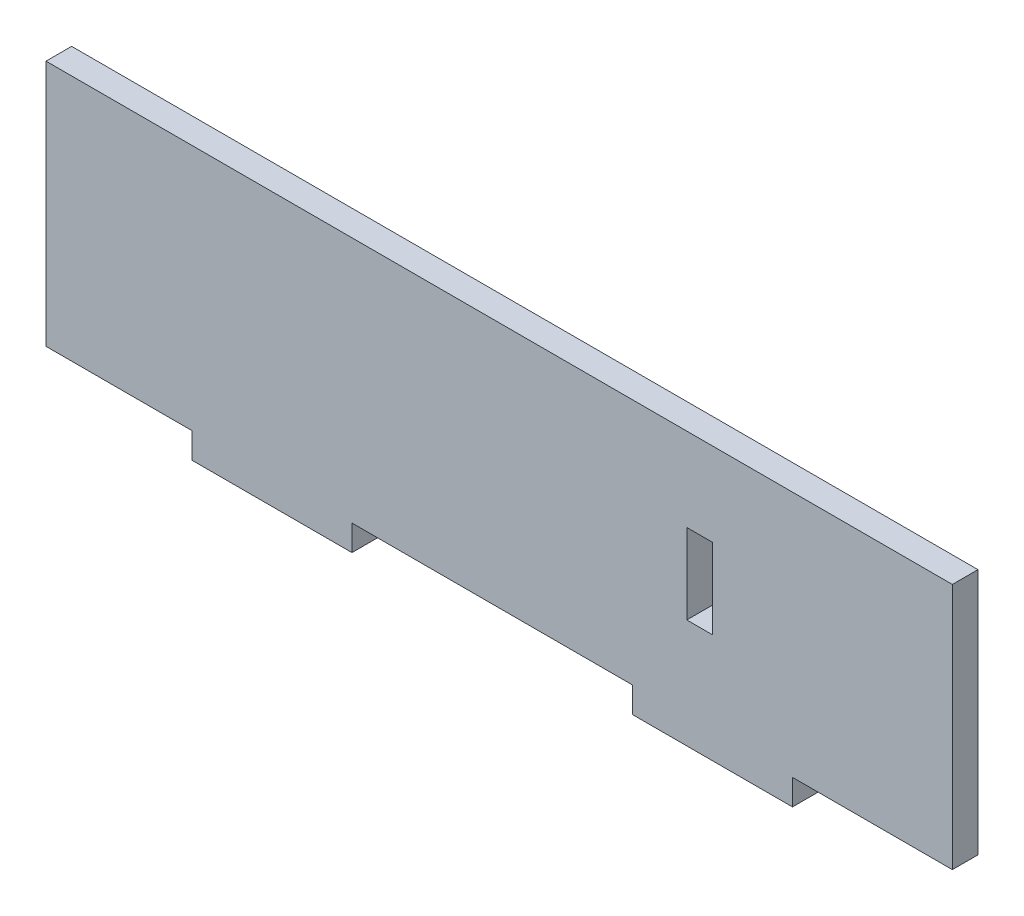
ISO-10303-21;
HEADER;
FILE_DESCRIPTION(('STEP AP214'),'2;1');
FILE_NAME('part.step','',(''),(''),'','','');
FILE_SCHEMA(('AUTOMOTIVE_DESIGN { 1 0 10303 214 1 1 1 1 }'));
ENDSEC;
DATA;
#1=APPLICATION_CONTEXT('core data for automotive mechanical design processes');
#2=APPLICATION_PROTOCOL_DEFINITION('international standard','automotive_design',2000,#1);
#3=PRODUCT_CONTEXT('',#1,'mechanical');
#4=PRODUCT('Part','Part','',(#3));
#5=PRODUCT_RELATED_PRODUCT_CATEGORY('part','',(#4));
#6=PRODUCT_DEFINITION_FORMATION('','',#4);
#7=PRODUCT_DEFINITION_CONTEXT('part definition',#1,'design');
#8=PRODUCT_DEFINITION('design','',#6,#7);
#9=PRODUCT_DEFINITION_SHAPE('','',#8);
#10=(LENGTH_UNIT() NAMED_UNIT(*) SI_UNIT(.MILLI.,.METRE.));
#11=(NAMED_UNIT(*) PLANE_ANGLE_UNIT() SI_UNIT($,.RADIAN.));
#12=(NAMED_UNIT(*) SI_UNIT($,.STERADIAN.) SOLID_ANGLE_UNIT());
#13=UNCERTAINTY_MEASURE_WITH_UNIT(LENGTH_MEASURE(1.E-05),#10,'distance_accuracy_value','');
#14=(GEOMETRIC_REPRESENTATION_CONTEXT(3) GLOBAL_UNCERTAINTY_ASSIGNED_CONTEXT((#13)) GLOBAL_UNIT_ASSIGNED_CONTEXT((#10,
#11,#12)) REPRESENTATION_CONTEXT('',''));
#15=CARTESIAN_POINT('',(0.,0.,0.));
#16=DIRECTION('',(0.,0.,1.));
#17=DIRECTION('',(1.,0.,0.));
#18=AXIS2_PLACEMENT_3D('',#15,#16,#17);
#19=CARTESIAN_POINT('',(200.,3.38569653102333,16.));
#20=DIRECTION('',(1.,0.,0.));
#21=DIRECTION('',(0.,0.,-1.));
#22=AXIS2_PLACEMENT_3D('',#19,#20,#21);
#23=PLANE('',#22);
#24=DIRECTION('',(0.,-1.,0.));
#25=VECTOR('',#24,1.);
#26=CARTESIAN_POINT('',(200.,3.38569653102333,0.));
#27=LINE('',#26,#25);
#28=CARTESIAN_POINT('',(200.,3.38569653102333,0.));
#29=VERTEX_POINT('',#28);
#30=CARTESIAN_POINT('',(200.,-12.6143034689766,0.));
#31=VERTEX_POINT('',#30);
#32=EDGE_CURVE('E225',#29,#31,#27,.T.);
#33=ORIENTED_EDGE('',*,*,#32,.F.);
#34=DIRECTION('',(0.,0.,-1.));
#35=VECTOR('',#34,1.);
#36=CARTESIAN_POINT('',(200.,3.38569653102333,16.));
#37=LINE('',#36,#35);
#38=CARTESIAN_POINT('',(200.,3.38569653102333,16.));
#39=VERTEX_POINT('',#38);
#40=EDGE_CURVE('E12',#39,#29,#37,.T.);
#41=ORIENTED_EDGE('',*,*,#40,.F.);
#42=DIRECTION('',(0.,-1.,0.));
#43=VECTOR('',#42,1.);
#44=CARTESIAN_POINT('',(200.,3.38569653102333,16.));
#45=LINE('',#44,#43);
#46=CARTESIAN_POINT('',(200.,-12.6143034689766,16.));
#47=VERTEX_POINT('',#46);
#48=EDGE_CURVE('E229',#39,#47,#45,.T.);
#49=ORIENTED_EDGE('',*,*,#48,.T.);
#50=DIRECTION('',(0.,0.,-1.));
#51=VECTOR('',#50,1.);
#52=CARTESIAN_POINT('',(200.,-12.6143034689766,16.));
#53=LINE('',#52,#51);
#54=EDGE_CURVE('E84',#47,#31,#53,.T.);
#55=ORIENTED_EDGE('',*,*,#54,.T.);
#56=EDGE_LOOP('',(#33,#41,#49,#55));
#57=FACE_BOUND('',#56,.T.);
#58=ADVANCED_FACE('F81',(#57),#23,.T.);
#59=CARTESIAN_POINT('',(200.,3.38569653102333,16.));
#60=DIRECTION('',(0.,1.,0.));
#61=DIRECTION('',(0.,0.,1.));
#62=AXIS2_PLACEMENT_3D('',#59,#60,#61);
#63=PLANE('',#62);
#64=DIRECTION('',(1.,0.,0.));
#65=VECTOR('',#64,1.);
#66=CARTESIAN_POINT('',(200.,3.38569653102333,0.));
#67=LINE('',#66,#65);
#68=CARTESIAN_POINT('',(375.,3.38569653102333,0.));
#69=VERTEX_POINT('',#68);
#70=EDGE_CURVE('E233',#29,#69,#67,.T.);
#71=ORIENTED_EDGE('',*,*,#70,.T.);
#72=DIRECTION('',(0.,0.,-1.));
#73=VECTOR('',#72,1.);
#74=CARTESIAN_POINT('',(375.,3.38569653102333,16.));
#75=LINE('',#74,#73);
#76=CARTESIAN_POINT('',(375.,3.38569653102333,16.));
#77=VERTEX_POINT('',#76);
#78=EDGE_CURVE('E89',#77,#69,#75,.T.);
#79=ORIENTED_EDGE('',*,*,#78,.F.);
#80=DIRECTION('',(1.,0.,0.));
#81=VECTOR('',#80,1.);
#82=CARTESIAN_POINT('',(200.,3.38569653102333,16.));
#83=LINE('',#82,#81);
#84=EDGE_CURVE('E256',#39,#77,#83,.T.);
#85=ORIENTED_EDGE('',*,*,#84,.F.);
#86=ORIENTED_EDGE('',*,*,#40,.T.);
#87=EDGE_LOOP('',(#71,#79,#85,#86));
#88=FACE_BOUND('',#87,.T.);
#89=ADVANCED_FACE('F326',(#88),#63,.F.);
#90=CARTESIAN_POINT('',(375.,3.38569653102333,16.));
#91=DIRECTION('',(1.,0.,0.));
#92=DIRECTION('',(0.,0.,-1.));
#93=AXIS2_PLACEMENT_3D('',#90,#91,#92);
#94=PLANE('',#93);
#95=DIRECTION('',(0.,-1.,0.));
#96=VECTOR('',#95,1.);
#97=CARTESIAN_POINT('',(375.,3.38569653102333,0.));
#98=LINE('',#97,#96);
#99=CARTESIAN_POINT('',(375.,-12.6143034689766,0.));
#100=VERTEX_POINT('',#99);
#101=EDGE_CURVE('E284',#69,#100,#98,.T.);
#102=ORIENTED_EDGE('',*,*,#101,.T.);
#103=DIRECTION('',(0.,0.,-1.));
#104=VECTOR('',#103,1.);
#105=CARTESIAN_POINT('',(375.,-12.6143034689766,16.));
#106=LINE('',#105,#104);
#107=CARTESIAN_POINT('',(375.,-12.6143034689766,16.));
#108=VERTEX_POINT('',#107);
#109=EDGE_CURVE('E289',#108,#100,#106,.T.);
#110=ORIENTED_EDGE('',*,*,#109,.F.);
#111=DIRECTION('',(0.,-1.,0.));
#112=VECTOR('',#111,1.);
#113=CARTESIAN_POINT('',(375.,3.38569653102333,16.));
#114=LINE('',#113,#112);
#115=EDGE_CURVE('E254',#77,#108,#114,.T.);
#116=ORIENTED_EDGE('',*,*,#115,.F.);
#117=ORIENTED_EDGE('',*,*,#78,.T.);
#118=EDGE_LOOP('',(#102,#110,#116,#117));
#119=FACE_BOUND('',#118,.T.);
#120=ADVANCED_FACE('F330',(#119),#94,.F.);
#121=CARTESIAN_POINT('',(375.,-12.6143034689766,16.));
#122=DIRECTION('',(0.,1.,0.));
#123=DIRECTION('',(0.,0.,1.));
#124=AXIS2_PLACEMENT_3D('',#121,#122,#123);
#125=PLANE('',#124);
#126=DIRECTION('',(1.,0.,0.));
#127=VECTOR('',#126,1.);
#128=CARTESIAN_POINT('',(375.,-12.6143034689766,0.));
#129=LINE('',#128,#127);
#130=CARTESIAN_POINT('',(475.,-12.6143034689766,0.));
#131=VERTEX_POINT('',#130);
#132=EDGE_CURVE('E281',#100,#131,#129,.T.);
#133=ORIENTED_EDGE('',*,*,#132,.T.);
#134=DIRECTION('',(0.,0.,-1.));
#135=VECTOR('',#134,1.);
#136=CARTESIAN_POINT('',(475.,-12.6143034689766,16.));
#137=LINE('',#136,#135);
#138=CARTESIAN_POINT('',(475.,-12.6143034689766,16.));
#139=VERTEX_POINT('',#138);
#140=EDGE_CURVE('E292',#139,#131,#137,.T.);
#141=ORIENTED_EDGE('',*,*,#140,.F.);
#142=DIRECTION('',(1.,0.,0.));
#143=VECTOR('',#142,1.);
#144=CARTESIAN_POINT('',(375.,-12.6143034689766,16.));
#145=LINE('',#144,#143);
#146=EDGE_CURVE('E252',#108,#139,#145,.T.);
#147=ORIENTED_EDGE('',*,*,#146,.F.);
#148=ORIENTED_EDGE('',*,*,#109,.T.);
#149=EDGE_LOOP('',(#133,#141,#147,#148));
#150=FACE_BOUND('',#149,.T.);
#151=ADVANCED_FACE('F365',(#150),#125,.F.);
#152=CARTESIAN_POINT('',(475.,3.38569653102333,16.));
#153=DIRECTION('',(1.,0.,0.));
#154=DIRECTION('',(0.,0.,-1.));
#155=AXIS2_PLACEMENT_3D('',#152,#153,#154);
#156=PLANE('',#155);
#157=DIRECTION('',(0.,-1.,0.));
#158=VECTOR('',#157,1.);
#159=CARTESIAN_POINT('',(475.,3.38569653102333,0.));
#160=LINE('',#159,#158);
#161=CARTESIAN_POINT('',(475.,3.38569653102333,0.));
#162=VERTEX_POINT('',#161);
#163=EDGE_CURVE('E278',#162,#131,#160,.T.);
#164=ORIENTED_EDGE('',*,*,#163,.F.);
#165=DIRECTION('',(0.,0.,-1.));
#166=VECTOR('',#165,1.);
#167=CARTESIAN_POINT('',(475.,3.38569653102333,16.));
#168=LINE('',#167,#166);
#169=CARTESIAN_POINT('',(475.,3.38569653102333,16.));
#170=VERTEX_POINT('',#169);
#171=EDGE_CURVE('E294',#170,#162,#168,.T.);
#172=ORIENTED_EDGE('',*,*,#171,.F.);
#173=DIRECTION('',(0.,-1.,0.));
#174=VECTOR('',#173,1.);
#175=CARTESIAN_POINT('',(475.,3.38569653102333,16.));
#176=LINE('',#175,#174);
#177=EDGE_CURVE('E249',#170,#139,#176,.T.);
#178=ORIENTED_EDGE('',*,*,#177,.T.);
#179=ORIENTED_EDGE('',*,*,#140,.T.);
#180=EDGE_LOOP('',(#164,#172,#178,#179));
#181=FACE_BOUND('',#180,.T.);
#182=ADVANCED_FACE('F363',(#181),#156,.T.);
#183=CARTESIAN_POINT('',(475.,3.38569653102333,16.));
#184=DIRECTION('',(0.,1.,0.));
#185=DIRECTION('',(0.,0.,1.));
#186=AXIS2_PLACEMENT_3D('',#183,#184,#185);
#187=PLANE('',#186);
#188=DIRECTION('',(1.,0.,0.));
#189=VECTOR('',#188,1.);
#190=CARTESIAN_POINT('',(475.,3.38569653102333,0.));
#191=LINE('',#190,#189);
#192=CARTESIAN_POINT('',(574.8,3.38569653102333,0.));
#193=VERTEX_POINT('',#192);
#194=EDGE_CURVE('E275',#162,#193,#191,.T.);
#195=ORIENTED_EDGE('',*,*,#194,.T.);
#196=DIRECTION('',(0.,0.,-1.));
#197=VECTOR('',#196,1.);
#198=CARTESIAN_POINT('',(574.8,3.38569653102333,16.));
#199=LINE('',#198,#197);
#200=CARTESIAN_POINT('',(574.8,3.38569653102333,16.));
#201=VERTEX_POINT('',#200);
#202=EDGE_CURVE('E296',#201,#193,#199,.T.);
#203=ORIENTED_EDGE('',*,*,#202,.F.);
#204=DIRECTION('',(1.,0.,0.));
#205=VECTOR('',#204,1.);
#206=CARTESIAN_POINT('',(475.,3.38569653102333,16.));
#207=LINE('',#206,#205);
#208=EDGE_CURVE('E247',#170,#201,#207,.T.);
#209=ORIENTED_EDGE('',*,*,#208,.F.);
#210=ORIENTED_EDGE('',*,*,#171,.T.);
#211=EDGE_LOOP('',(#195,#203,#209,#210));
#212=FACE_BOUND('',#211,.T.);
#213=ADVANCED_FACE('F361',(#212),#187,.F.);
#214=CARTESIAN_POINT('',(574.8,157.585696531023,16.));
#215=DIRECTION('',(1.,0.,0.));
#216=DIRECTION('',(0.,0.,-1.));
#217=AXIS2_PLACEMENT_3D('',#214,#215,#216);
#218=PLANE('',#217);
#219=DIRECTION('',(0.,-1.,0.));
#220=VECTOR('',#219,1.);
#221=CARTESIAN_POINT('',(574.8,157.585696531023,0.));
#222=LINE('',#221,#220);
#223=CARTESIAN_POINT('',(574.8,157.585696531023,0.));
#224=VERTEX_POINT('',#223);
#225=EDGE_CURVE('E272',#224,#193,#222,.T.);
#226=ORIENTED_EDGE('',*,*,#225,.F.);
#227=DIRECTION('',(0.,0.,-1.));
#228=VECTOR('',#227,1.);
#229=CARTESIAN_POINT('',(574.8,157.585696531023,16.));
#230=LINE('',#229,#228);
#231=CARTESIAN_POINT('',(574.8,157.585696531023,16.));
#232=VERTEX_POINT('',#231);
#233=EDGE_CURVE('E298',#232,#224,#230,.T.);
#234=ORIENTED_EDGE('',*,*,#233,.F.);
#235=DIRECTION('',(0.,-1.,0.));
#236=VECTOR('',#235,1.);
#237=CARTESIAN_POINT('',(574.8,157.585696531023,16.));
#238=LINE('',#237,#236);
#239=EDGE_CURVE('E244',#232,#201,#238,.T.);
#240=ORIENTED_EDGE('',*,*,#239,.T.);
#241=ORIENTED_EDGE('',*,*,#202,.T.);
#242=EDGE_LOOP('',(#226,#234,#240,#241));
#243=FACE_BOUND('',#242,.T.);
#244=ADVANCED_FACE('F356',(#243),#218,.T.);
#245=CARTESIAN_POINT('',(9.00000000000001,157.585696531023,16.));
#246=DIRECTION('',(0.,1.,0.));
#247=DIRECTION('',(0.,0.,1.));
#248=AXIS2_PLACEMENT_3D('',#245,#246,#247);
#249=PLANE('',#248);
#250=DIRECTION('',(1.,0.,0.));
#251=VECTOR('',#250,1.);
#252=CARTESIAN_POINT('',(9.00000000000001,157.585696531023,0.));
#253=LINE('',#252,#251);
#254=CARTESIAN_POINT('',(9.00000000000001,157.585696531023,0.));
#255=VERTEX_POINT('',#254);
#256=EDGE_CURVE('E269',#255,#224,#253,.T.);
#257=ORIENTED_EDGE('',*,*,#256,.F.);
#258=DIRECTION('',(0.,0.,-1.));
#259=VECTOR('',#258,1.);
#260=CARTESIAN_POINT('',(9.00000000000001,157.585696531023,16.));
#261=LINE('',#260,#259);
#262=CARTESIAN_POINT('',(9.00000000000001,157.585696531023,16.));
#263=VERTEX_POINT('',#262);
#264=EDGE_CURVE('E300',#263,#255,#261,.T.);
#265=ORIENTED_EDGE('',*,*,#264,.F.);
#266=DIRECTION('',(1.,0.,0.));
#267=VECTOR('',#266,1.);
#268=CARTESIAN_POINT('',(9.00000000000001,157.585696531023,16.));
#269=LINE('',#268,#267);
#270=EDGE_CURVE('E241',#263,#232,#269,.T.);
#271=ORIENTED_EDGE('',*,*,#270,.T.);
#272=ORIENTED_EDGE('',*,*,#233,.T.);
#273=EDGE_LOOP('',(#257,#265,#271,#272));
#274=FACE_BOUND('',#273,.T.);
#275=ADVANCED_FACE('F351',(#274),#249,.T.);
#276=CARTESIAN_POINT('',(9.00000000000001,157.585696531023,16.));
#277=DIRECTION('',(1.,0.,0.));
#278=DIRECTION('',(0.,0.,-1.));
#279=AXIS2_PLACEMENT_3D('',#276,#277,#278);
#280=PLANE('',#279);
#281=DIRECTION('',(0.,-1.,0.));
#282=VECTOR('',#281,1.);
#283=CARTESIAN_POINT('',(9.00000000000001,157.585696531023,0.));
#284=LINE('',#283,#282);
#285=CARTESIAN_POINT('',(9.00000000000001,3.38569653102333,0.));
#286=VERTEX_POINT('',#285);
#287=EDGE_CURVE('E267',#255,#286,#284,.T.);
#288=ORIENTED_EDGE('',*,*,#287,.T.);
#289=DIRECTION('',(0.,0.,-1.));
#290=VECTOR('',#289,1.);
#291=CARTESIAN_POINT('',(9.00000000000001,3.38569653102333,16.));
#292=LINE('',#291,#290);
#293=CARTESIAN_POINT('',(9.00000000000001,3.38569653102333,16.));
#294=VERTEX_POINT('',#293);
#295=EDGE_CURVE('E302',#294,#286,#292,.T.);
#296=ORIENTED_EDGE('',*,*,#295,.F.);
#297=DIRECTION('',(0.,-1.,0.));
#298=VECTOR('',#297,1.);
#299=CARTESIAN_POINT('',(9.00000000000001,157.585696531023,16.));
#300=LINE('',#299,#298);
#301=EDGE_CURVE('E239',#263,#294,#300,.T.);
#302=ORIENTED_EDGE('',*,*,#301,.F.);
#303=ORIENTED_EDGE('',*,*,#264,.T.);
#304=EDGE_LOOP('',(#288,#296,#302,#303));
#305=FACE_BOUND('',#304,.T.);
#306=ADVANCED_FACE('F348',(#305),#280,.F.);
#307=CARTESIAN_POINT('',(9.00000000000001,3.38569653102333,16.));
#308=DIRECTION('',(0.,1.,0.));
#309=DIRECTION('',(0.,0.,1.));
#310=AXIS2_PLACEMENT_3D('',#307,#308,#309);
#311=PLANE('',#310);
#312=DIRECTION('',(1.,0.,0.));
#313=VECTOR('',#312,1.);
#314=CARTESIAN_POINT('',(9.00000000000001,3.38569653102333,0.));
#315=LINE('',#314,#313);
#316=CARTESIAN_POINT('',(100.,3.38569653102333,0.));
#317=VERTEX_POINT('',#316);
#318=EDGE_CURVE('E265',#286,#317,#315,.T.);
#319=ORIENTED_EDGE('',*,*,#318,.T.);
#320=DIRECTION('',(0.,0.,-1.));
#321=VECTOR('',#320,1.);
#322=CARTESIAN_POINT('',(100.,3.38569653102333,16.));
#323=LINE('',#322,#321);
#324=CARTESIAN_POINT('',(100.,3.38569653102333,16.));
#325=VERTEX_POINT('',#324);
#326=EDGE_CURVE('E305',#325,#317,#323,.T.);
#327=ORIENTED_EDGE('',*,*,#326,.F.);
#328=DIRECTION('',(1.,0.,0.));
#329=VECTOR('',#328,1.);
#330=CARTESIAN_POINT('',(9.00000000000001,3.38569653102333,16.));
#331=LINE('',#330,#329);
#332=EDGE_CURVE('E237',#294,#325,#331,.T.);
#333=ORIENTED_EDGE('',*,*,#332,.F.);
#334=ORIENTED_EDGE('',*,*,#295,.T.);
#335=EDGE_LOOP('',(#319,#327,#333,#334));
#336=FACE_BOUND('',#335,.T.);
#337=ADVANCED_FACE('F344',(#336),#311,.F.);
#338=CARTESIAN_POINT('',(100.,3.38569653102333,16.));
#339=DIRECTION('',(1.,0.,0.));
#340=DIRECTION('',(0.,0.,-1.));
#341=AXIS2_PLACEMENT_3D('',#338,#339,#340);
#342=PLANE('',#341);
#343=DIRECTION('',(0.,-1.,0.));
#344=VECTOR('',#343,1.);
#345=CARTESIAN_POINT('',(100.,3.38569653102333,0.));
#346=LINE('',#345,#344);
#347=CARTESIAN_POINT('',(100.,-12.6143034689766,0.));
#348=VERTEX_POINT('',#347);
#349=EDGE_CURVE('E263',#317,#348,#346,.T.);
#350=ORIENTED_EDGE('',*,*,#349,.T.);
#351=DIRECTION('',(0.,0.,-1.));
#352=VECTOR('',#351,1.);
#353=CARTESIAN_POINT('',(100.,-12.6143034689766,16.));
#354=LINE('',#353,#352);
#355=CARTESIAN_POINT('',(100.,-12.6143034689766,16.));
#356=VERTEX_POINT('',#355);
#357=EDGE_CURVE('E307',#356,#348,#354,.T.);
#358=ORIENTED_EDGE('',*,*,#357,.F.);
#359=DIRECTION('',(0.,-1.,0.));
#360=VECTOR('',#359,1.);
#361=CARTESIAN_POINT('',(100.,3.38569653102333,16.));
#362=LINE('',#361,#360);
#363=EDGE_CURVE('E235',#325,#356,#362,.T.);
#364=ORIENTED_EDGE('',*,*,#363,.F.);
#365=ORIENTED_EDGE('',*,*,#326,.T.);
#366=EDGE_LOOP('',(#350,#358,#364,#365));
#367=FACE_BOUND('',#366,.T.);
#368=ADVANCED_FACE('F339',(#367),#342,.F.);
#369=CARTESIAN_POINT('',(100.,-12.6143034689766,16.));
#370=DIRECTION('',(0.,1.,0.));
#371=DIRECTION('',(-1.,0.,0.));
#372=AXIS2_PLACEMENT_3D('',#369,#370,#371);
#373=PLANE('',#372);
#374=DIRECTION('',(1.,0.,0.));
#375=VECTOR('',#374,1.);
#376=CARTESIAN_POINT('',(100.,-12.6143034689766,0.));
#377=LINE('',#376,#375);
#378=EDGE_CURVE('E260',#348,#31,#377,.T.);
#379=ORIENTED_EDGE('',*,*,#378,.T.);
#380=ORIENTED_EDGE('',*,*,#54,.F.);
#381=DIRECTION('',(1.,0.,0.));
#382=VECTOR('',#381,1.);
#383=CARTESIAN_POINT('',(100.,-12.6143034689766,16.));
#384=LINE('',#383,#382);
#385=EDGE_CURVE('E232',#356,#47,#384,.T.);
#386=ORIENTED_EDGE('',*,*,#385,.F.);
#387=ORIENTED_EDGE('',*,*,#357,.T.);
#388=EDGE_LOOP('',(#379,#380,#386,#387));
#389=FACE_BOUND('',#388,.T.);
#390=ADVANCED_FACE('F317',(#389),#373,.F.);
#391=CARTESIAN_POINT('',(0.,0.,16.));
#392=DIRECTION('',(0.,0.,1.));
#393=DIRECTION('',(1.,0.,0.));
#394=AXIS2_PLACEMENT_3D('',#391,#392,#393);
#395=PLANE('',#394);
#396=DIRECTION('',(1.,0.,0.));
#397=VECTOR('',#396,1.);
#398=CARTESIAN_POINT('',(409.,105.485696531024,16.));
#399=LINE('',#398,#397);
#400=CARTESIAN_POINT('',(409.,105.485696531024,16.));
#401=VERTEX_POINT('',#400);
#402=CARTESIAN_POINT('',(425.,105.485696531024,16.));
#403=VERTEX_POINT('',#402);
#404=EDGE_CURVE('E196',#401,#403,#399,.T.);
#405=ORIENTED_EDGE('',*,*,#404,.T.);
#406=DIRECTION('',(0.,-1.,0.));
#407=VECTOR('',#406,1.);
#408=CARTESIAN_POINT('',(425.,105.485696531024,16.));
#409=LINE('',#408,#407);
#410=CARTESIAN_POINT('',(425.,55.4856965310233,16.));
#411=VERTEX_POINT('',#410);
#412=EDGE_CURVE('E202',#403,#411,#409,.T.);
#413=ORIENTED_EDGE('',*,*,#412,.T.);
#414=DIRECTION('',(1.,0.,0.));
#415=VECTOR('',#414,1.);
#416=CARTESIAN_POINT('',(409.,55.4856965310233,16.));
#417=LINE('',#416,#415);
#418=CARTESIAN_POINT('',(409.,55.4856965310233,16.));
#419=VERTEX_POINT('',#418);
#420=EDGE_CURVE('E206',#419,#411,#417,.T.);
#421=ORIENTED_EDGE('',*,*,#420,.F.);
#422=DIRECTION('',(0.,-1.,0.));
#423=VECTOR('',#422,1.);
#424=CARTESIAN_POINT('',(409.,105.485696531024,16.));
#425=LINE('',#424,#423);
#426=EDGE_CURVE('E199',#401,#419,#425,.T.);
#427=ORIENTED_EDGE('',*,*,#426,.F.);
#428=EDGE_LOOP('',(#405,#413,#421,#427));
#429=FACE_BOUND('',#428,.T.);
#430=ORIENTED_EDGE('',*,*,#48,.F.);
#431=ORIENTED_EDGE('',*,*,#84,.T.);
#432=ORIENTED_EDGE('',*,*,#115,.T.);
#433=ORIENTED_EDGE('',*,*,#146,.T.);
#434=ORIENTED_EDGE('',*,*,#177,.F.);
#435=ORIENTED_EDGE('',*,*,#208,.T.);
#436=ORIENTED_EDGE('',*,*,#239,.F.);
#437=ORIENTED_EDGE('',*,*,#270,.F.);
#438=ORIENTED_EDGE('',*,*,#301,.T.);
#439=ORIENTED_EDGE('',*,*,#332,.T.);
#440=ORIENTED_EDGE('',*,*,#363,.T.);
#441=ORIENTED_EDGE('',*,*,#385,.T.);
#442=EDGE_LOOP('',(#430,#431,#432,#433,#434,#435,#436,#437,#438,#439,#440,#441));
#443=FACE_BOUND('',#442,.T.);
#444=ADVANCED_FACE('F208',(#429,#443),#395,.T.);
#445=CARTESIAN_POINT('',(0.,0.,0.));
#446=DIRECTION('',(0.,0.,1.));
#447=DIRECTION('',(1.,0.,0.));
#448=AXIS2_PLACEMENT_3D('',#445,#446,#447);
#449=PLANE('',#448);
#450=DIRECTION('',(0.,-1.,0.));
#451=VECTOR('',#450,1.);
#452=CARTESIAN_POINT('',(425.,105.485696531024,0.));
#453=LINE('',#452,#451);
#454=CARTESIAN_POINT('',(425.,105.485696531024,0.));
#455=VERTEX_POINT('',#454);
#456=CARTESIAN_POINT('',(425.,55.4856965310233,0.));
#457=VERTEX_POINT('',#456);
#458=EDGE_CURVE('E219',#455,#457,#453,.T.);
#459=ORIENTED_EDGE('',*,*,#458,.F.);
#460=DIRECTION('',(1.,0.,0.));
#461=VECTOR('',#460,1.);
#462=CARTESIAN_POINT('',(409.,105.485696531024,0.));
#463=LINE('',#462,#461);
#464=CARTESIAN_POINT('',(409.,105.485696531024,0.));
#465=VERTEX_POINT('',#464);
#466=EDGE_CURVE('E105',#465,#455,#463,.T.);
#467=ORIENTED_EDGE('',*,*,#466,.F.);
#468=DIRECTION('',(0.,-1.,0.));
#469=VECTOR('',#468,1.);
#470=CARTESIAN_POINT('',(409.,105.485696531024,0.));
#471=LINE('',#470,#469);
#472=CARTESIAN_POINT('',(409.,55.4856965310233,0.));
#473=VERTEX_POINT('',#472);
#474=EDGE_CURVE('E210',#465,#473,#471,.T.);
#475=ORIENTED_EDGE('',*,*,#474,.T.);
#476=DIRECTION('',(1.,0.,0.));
#477=VECTOR('',#476,1.);
#478=CARTESIAN_POINT('',(409.,55.4856965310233,0.));
#479=LINE('',#478,#477);
#480=EDGE_CURVE('E213',#473,#457,#479,.T.);
#481=ORIENTED_EDGE('',*,*,#480,.T.);
#482=EDGE_LOOP('',(#459,#467,#475,#481));
#483=FACE_BOUND('',#482,.T.);
#484=ORIENTED_EDGE('',*,*,#32,.T.);
#485=ORIENTED_EDGE('',*,*,#378,.F.);
#486=ORIENTED_EDGE('',*,*,#349,.F.);
#487=ORIENTED_EDGE('',*,*,#318,.F.);
#488=ORIENTED_EDGE('',*,*,#287,.F.);
#489=ORIENTED_EDGE('',*,*,#256,.T.);
#490=ORIENTED_EDGE('',*,*,#225,.T.);
#491=ORIENTED_EDGE('',*,*,#194,.F.);
#492=ORIENTED_EDGE('',*,*,#163,.T.);
#493=ORIENTED_EDGE('',*,*,#132,.F.);
#494=ORIENTED_EDGE('',*,*,#101,.F.);
#495=ORIENTED_EDGE('',*,*,#70,.F.);
#496=EDGE_LOOP('',(#484,#485,#486,#487,#488,#489,#490,#491,#492,#493,#494,#495));
#497=FACE_BOUND('',#496,.T.);
#498=ADVANCED_FACE('F321',(#483,#497),#449,.F.);
#499=CARTESIAN_POINT('',(409.,105.485696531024,16.));
#500=DIRECTION('',(0.,1.,0.));
#501=DIRECTION('',(-1.,0.,0.));
#502=AXIS2_PLACEMENT_3D('',#499,#500,#501);
#503=PLANE('',#502);
#504=ORIENTED_EDGE('',*,*,#466,.T.);
#505=DIRECTION('',(0.,0.,-1.));
#506=VECTOR('',#505,1.);
#507=CARTESIAN_POINT('',(425.,105.485696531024,16.));
#508=LINE('',#507,#506);
#509=EDGE_CURVE('E193',#403,#455,#508,.T.);
#510=ORIENTED_EDGE('',*,*,#509,.F.);
#511=ORIENTED_EDGE('',*,*,#404,.F.);
#512=DIRECTION('',(0.,0.,-1.));
#513=VECTOR('',#512,1.);
#514=CARTESIAN_POINT('',(409.,105.485696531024,16.));
#515=LINE('',#514,#513);
#516=EDGE_CURVE('E223',#401,#465,#515,.T.);
#517=ORIENTED_EDGE('',*,*,#516,.T.);
#518=EDGE_LOOP('',(#504,#510,#511,#517));
#519=FACE_BOUND('',#518,.T.);
#520=ADVANCED_FACE('F194',(#519),#503,.F.);
#521=CARTESIAN_POINT('',(409.,105.485696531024,16.));
#522=DIRECTION('',(1.,0.,0.));
#523=DIRECTION('',(0.,0.,-1.));
#524=AXIS2_PLACEMENT_3D('',#521,#522,#523);
#525=PLANE('',#524);
#526=ORIENTED_EDGE('',*,*,#474,.F.);
#527=ORIENTED_EDGE('',*,*,#516,.F.);
#528=ORIENTED_EDGE('',*,*,#426,.T.);
#529=DIRECTION('',(0.,0.,-1.));
#530=VECTOR('',#529,1.);
#531=CARTESIAN_POINT('',(409.,55.4856965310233,16.));
#532=LINE('',#531,#530);
#533=EDGE_CURVE('E226',#419,#473,#532,.T.);
#534=ORIENTED_EDGE('',*,*,#533,.T.);
#535=EDGE_LOOP('',(#526,#527,#528,#534));
#536=FACE_BOUND('',#535,.T.);
#537=ADVANCED_FACE('F389',(#536),#525,.T.);
#538=CARTESIAN_POINT('',(409.,55.4856965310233,16.));
#539=DIRECTION('',(0.,1.,0.));
#540=DIRECTION('',(0.,0.,1.));
#541=AXIS2_PLACEMENT_3D('',#538,#539,#540);
#542=PLANE('',#541);
#543=ORIENTED_EDGE('',*,*,#480,.F.);
#544=ORIENTED_EDGE('',*,*,#533,.F.);
#545=ORIENTED_EDGE('',*,*,#420,.T.);
#546=DIRECTION('',(0.,0.,-1.));
#547=VECTOR('',#546,1.);
#548=CARTESIAN_POINT('',(425.,55.4856965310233,16.));
#549=LINE('',#548,#547);
#550=EDGE_CURVE('E97',#411,#457,#549,.T.);
#551=ORIENTED_EDGE('',*,*,#550,.T.);
#552=EDGE_LOOP('',(#543,#544,#545,#551));
#553=FACE_BOUND('',#552,.T.);
#554=ADVANCED_FACE('F392',(#553),#542,.T.);
#555=CARTESIAN_POINT('',(425.,105.485696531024,16.));
#556=DIRECTION('',(1.,0.,0.));
#557=DIRECTION('',(0.,0.,-1.));
#558=AXIS2_PLACEMENT_3D('',#555,#556,#557);
#559=PLANE('',#558);
#560=ORIENTED_EDGE('',*,*,#458,.T.);
#561=ORIENTED_EDGE('',*,*,#550,.F.);
#562=ORIENTED_EDGE('',*,*,#412,.F.);
#563=ORIENTED_EDGE('',*,*,#509,.T.);
#564=EDGE_LOOP('',(#560,#561,#562,#563));
#565=FACE_BOUND('',#564,.T.);
#566=ADVANCED_FACE('F203',(#565),#559,.F.);
#567=CLOSED_SHELL('',(#58,#89,#120,#151,#182,#213,#244,#275,#306,#337,#368,#390,#444,#498,#520,
#537,#554,#566));
#568=MANIFOLD_SOLID_BREP('B2',#567);
#569=ADVANCED_BREP_SHAPE_REPRESENTATION('',(#18,#568),#14);
#570=SHAPE_DEFINITION_REPRESENTATION(#9,#569);
ENDSEC;
END-ISO-10303-21;
